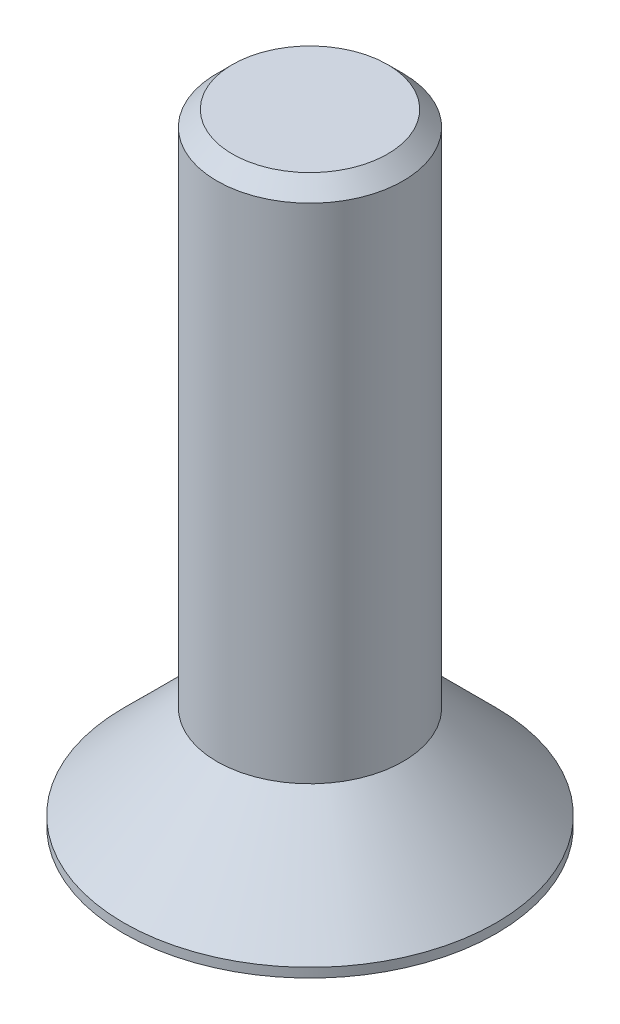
ISO-10303-21;
HEADER;
FILE_DESCRIPTION(('STEP AP214'),'2;1');
FILE_NAME('part.step','',(''),(''),'','','');
FILE_SCHEMA(('AUTOMOTIVE_DESIGN { 1 0 10303 214 1 1 1 1 }'));
ENDSEC;
DATA;
#1=APPLICATION_CONTEXT('core data for automotive mechanical design processes');
#2=APPLICATION_PROTOCOL_DEFINITION('international standard','automotive_design',2000,#1);
#3=PRODUCT_CONTEXT('',#1,'mechanical');
#4=PRODUCT('Part','Part','',(#3));
#5=PRODUCT_RELATED_PRODUCT_CATEGORY('part','',(#4));
#6=PRODUCT_DEFINITION_FORMATION('','',#4);
#7=PRODUCT_DEFINITION_CONTEXT('part definition',#1,'design');
#8=PRODUCT_DEFINITION('design','',#6,#7);
#9=PRODUCT_DEFINITION_SHAPE('','',#8);
#10=(LENGTH_UNIT() NAMED_UNIT(*) SI_UNIT(.MILLI.,.METRE.));
#11=(NAMED_UNIT(*) PLANE_ANGLE_UNIT() SI_UNIT($,.RADIAN.));
#12=(NAMED_UNIT(*) SI_UNIT($,.STERADIAN.) SOLID_ANGLE_UNIT());
#13=UNCERTAINTY_MEASURE_WITH_UNIT(LENGTH_MEASURE(1.E-05),#10,'distance_accuracy_value','');
#14=(GEOMETRIC_REPRESENTATION_CONTEXT(3) GLOBAL_UNCERTAINTY_ASSIGNED_CONTEXT((#13)) GLOBAL_UNIT_ASSIGNED_CONTEXT((#10,
#11,#12)) REPRESENTATION_CONTEXT('',''));
#15=CARTESIAN_POINT('',(0.,0.,0.));
#16=DIRECTION('',(0.,0.,1.));
#17=DIRECTION('',(1.,0.,0.));
#18=AXIS2_PLACEMENT_3D('',#15,#16,#17);
#19=CARTESIAN_POINT('',(-3.,20.,0.));
#20=DIRECTION('',(0.,-1.,0.));
#21=DIRECTION('',(0.,0.,-1.));
#22=AXIS2_PLACEMENT_3D('',#19,#20,#21);
#23=PLANE('',#22);
#24=CARTESIAN_POINT('',(0.,20.,0.));
#25=DIRECTION('',(0.,-1.,0.));
#26=DIRECTION('',(0.,0.,-1.));
#27=AXIS2_PLACEMENT_3D('',#24,#25,#26);
#28=CIRCLE('',#27,2.49999999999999);
#29=CARTESIAN_POINT('',(0.,20.,-2.49999999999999));
#30=VERTEX_POINT('',#29);
#31=EDGE_CURVE('E11',#30,#30,#28,.F.);
#32=ORIENTED_EDGE('',*,*,#31,.T.);
#33=EDGE_LOOP('',(#32));
#34=FACE_BOUND('',#33,.T.);
#35=ADVANCED_FACE('F35',(#34),#23,.F.);
#36=CARTESIAN_POINT('',(0.,0.,0.));
#37=DIRECTION('',(0.,-1.,0.));
#38=DIRECTION('',(0.,0.,-1.));
#39=AXIS2_PLACEMENT_3D('',#36,#37,#38);
#40=CYLINDRICAL_SURFACE('',#39,3.);
#41=CARTESIAN_POINT('',(0.,19.5,0.));
#42=DIRECTION('',(0.,-1.,0.));
#43=DIRECTION('',(0.,0.,-1.));
#44=AXIS2_PLACEMENT_3D('',#41,#42,#43);
#45=CIRCLE('',#44,3.);
#46=CARTESIAN_POINT('',(0.,19.5,-3.));
#47=VERTEX_POINT('',#46);
#48=EDGE_CURVE('E42',#47,#47,#45,.T.);
#49=ORIENTED_EDGE('',*,*,#48,.T.);
#50=EDGE_LOOP('',(#49));
#51=FACE_BOUND('',#50,.T.);
#52=CARTESIAN_POINT('',(0.,3.3,0.));
#53=DIRECTION('',(0.,-1.,0.));
#54=DIRECTION('',(0.,0.,-1.));
#55=AXIS2_PLACEMENT_3D('',#52,#53,#54);
#56=CIRCLE('',#55,3.);
#57=CARTESIAN_POINT('',(0.,3.3,-3.));
#58=VERTEX_POINT('',#57);
#59=EDGE_CURVE('E149',#58,#58,#56,.T.);
#60=ORIENTED_EDGE('',*,*,#59,.F.);
#61=EDGE_LOOP('',(#60));
#62=FACE_BOUND('',#61,.T.);
#63=ADVANCED_FACE('F154',(#51,#62),#40,.T.);
#64=CARTESIAN_POINT('',(0.,3.3,0.));
#65=DIRECTION('',(0.,-1.,0.));
#66=DIRECTION('',(0.,0.,-1.));
#67=AXIS2_PLACEMENT_3D('',#64,#65,#66);
#68=CONICAL_SURFACE('',#67,3.,0.785398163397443);
#69=CARTESIAN_POINT('',(0.,0.299999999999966,0.));
#70=DIRECTION('',(0.,-1.,0.));
#71=DIRECTION('',(0.,0.,-1.));
#72=AXIS2_PLACEMENT_3D('',#69,#70,#71);
#73=CIRCLE('',#72,6.);
#74=CARTESIAN_POINT('',(0.,0.299999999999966,-6.));
#75=VERTEX_POINT('',#74);
#76=EDGE_CURVE('E146',#75,#75,#73,.T.);
#77=ORIENTED_EDGE('',*,*,#76,.F.);
#78=EDGE_LOOP('',(#77));
#79=FACE_BOUND('',#78,.T.);
#80=ORIENTED_EDGE('',*,*,#59,.T.);
#81=EDGE_LOOP('',(#80));
#82=FACE_BOUND('',#81,.T.);
#83=ADVANCED_FACE('F176',(#79,#82),#68,.T.);
#84=CARTESIAN_POINT('',(0.,0.,0.));
#85=DIRECTION('',(0.,-1.,0.));
#86=DIRECTION('',(0.,0.,-1.));
#87=AXIS2_PLACEMENT_3D('',#84,#85,#86);
#88=CYLINDRICAL_SURFACE('',#87,6.);
#89=CARTESIAN_POINT('',(0.,0.,0.));
#90=DIRECTION('',(0.,-1.,0.));
#91=DIRECTION('',(0.,0.,-1.));
#92=AXIS2_PLACEMENT_3D('',#89,#90,#91);
#93=CIRCLE('',#92,6.);
#94=CARTESIAN_POINT('',(0.,0.,-6.));
#95=VERTEX_POINT('',#94);
#96=EDGE_CURVE('E137',#95,#95,#93,.T.);
#97=ORIENTED_EDGE('',*,*,#96,.F.);
#98=EDGE_LOOP('',(#97));
#99=FACE_BOUND('',#98,.T.);
#100=ORIENTED_EDGE('',*,*,#76,.T.);
#101=EDGE_LOOP('',(#100));
#102=FACE_BOUND('',#101,.T.);
#103=ADVANCED_FACE('F168',(#99,#102),#88,.T.);
#104=CARTESIAN_POINT('',(0.,0.,0.));
#105=DIRECTION('',(0.,1.,0.));
#106=DIRECTION('',(0.,0.,1.));
#107=AXIS2_PLACEMENT_3D('',#104,#105,#106);
#108=PLANE('',#107);
#109=DIRECTION('',(-0.866025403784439,0.,0.5));
#110=VECTOR('',#109,1.);
#111=CARTESIAN_POINT('',(2.,0.,1.15470053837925));
#112=LINE('',#111,#110);
#113=CARTESIAN_POINT('',(2.,0.,1.15470053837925));
#114=VERTEX_POINT('',#113);
#115=CARTESIAN_POINT('',(0.,0.,2.3094010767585));
#116=VERTEX_POINT('',#115);
#117=EDGE_CURVE('E103',#114,#116,#112,.T.);
#118=ORIENTED_EDGE('',*,*,#117,.F.);
#119=DIRECTION('',(0.,0.,1.));
#120=VECTOR('',#119,1.);
#121=CARTESIAN_POINT('',(2.,0.,-1.15470053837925));
#122=LINE('',#121,#120);
#123=CARTESIAN_POINT('',(2.,0.,-1.15470053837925));
#124=VERTEX_POINT('',#123);
#125=EDGE_CURVE('E49',#124,#114,#122,.T.);
#126=ORIENTED_EDGE('',*,*,#125,.F.);
#127=DIRECTION('',(0.866025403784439,0.,0.5));
#128=VECTOR('',#127,1.);
#129=CARTESIAN_POINT('',(0.,0.,-2.3094010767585));
#130=LINE('',#129,#128);
#131=CARTESIAN_POINT('',(0.,0.,-2.3094010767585));
#132=VERTEX_POINT('',#131);
#133=EDGE_CURVE('E119',#132,#124,#130,.T.);
#134=ORIENTED_EDGE('',*,*,#133,.F.);
#135=DIRECTION('',(0.866025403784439,0.,-0.5));
#136=VECTOR('',#135,1.);
#137=CARTESIAN_POINT('',(-2.,0.,-1.15470053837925));
#138=LINE('',#137,#136);
#139=CARTESIAN_POINT('',(-2.,0.,-1.15470053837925));
#140=VERTEX_POINT('',#139);
#141=EDGE_CURVE('E113',#140,#132,#138,.T.);
#142=ORIENTED_EDGE('',*,*,#141,.F.);
#143=DIRECTION('',(0.,0.,-1.));
#144=VECTOR('',#143,1.);
#145=CARTESIAN_POINT('',(-2.,0.,1.15470053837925));
#146=LINE('',#145,#144);
#147=CARTESIAN_POINT('',(-2.,0.,1.15470053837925));
#148=VERTEX_POINT('',#147);
#149=EDGE_CURVE('E111',#148,#140,#146,.T.);
#150=ORIENTED_EDGE('',*,*,#149,.F.);
#151=DIRECTION('',(-0.866025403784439,0.,-0.5));
#152=VECTOR('',#151,1.);
#153=CARTESIAN_POINT('',(0.,0.,2.3094010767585));
#154=LINE('',#153,#152);
#155=EDGE_CURVE('E92',#116,#148,#154,.T.);
#156=ORIENTED_EDGE('',*,*,#155,.F.);
#157=EDGE_LOOP('',(#118,#126,#134,#142,#150,#156));
#158=FACE_BOUND('',#157,.T.);
#159=ORIENTED_EDGE('',*,*,#96,.T.);
#160=EDGE_LOOP('',(#159));
#161=FACE_BOUND('',#160,.T.);
#162=ADVANCED_FACE('F107',(#158,#161),#108,.F.);
#163=CARTESIAN_POINT('',(0.,19.5,0.));
#164=DIRECTION('',(0.,-1.,0.));
#165=DIRECTION('',(0.,0.,-1.));
#166=AXIS2_PLACEMENT_3D('',#163,#164,#165);
#167=CONICAL_SURFACE('',#166,3.,0.78539816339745);
#168=ORIENTED_EDGE('',*,*,#31,.F.);
#169=EDGE_LOOP('',(#168));
#170=FACE_BOUND('',#169,.T.);
#171=ORIENTED_EDGE('',*,*,#48,.F.);
#172=EDGE_LOOP('',(#171));
#173=FACE_BOUND('',#172,.T.);
#174=ADVANCED_FACE('F157',(#170,#173),#167,.T.);
#175=CARTESIAN_POINT('',(2.,2.,-1.15470053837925));
#176=DIRECTION('',(1.,0.,0.));
#177=DIRECTION('',(0.,0.,-1.));
#178=AXIS2_PLACEMENT_3D('',#175,#176,#177);
#179=PLANE('',#178);
#180=ORIENTED_EDGE('',*,*,#125,.T.);
#181=DIRECTION('',(0.,-1.,0.));
#182=VECTOR('',#181,1.);
#183=CARTESIAN_POINT('',(2.,2.,1.15470053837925));
#184=LINE('',#183,#182);
#185=CARTESIAN_POINT('',(2.,2.,1.15470053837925));
#186=VERTEX_POINT('',#185);
#187=EDGE_CURVE('E100',#186,#114,#184,.T.);
#188=ORIENTED_EDGE('',*,*,#187,.F.);
#189=DIRECTION('',(0.,0.,1.));
#190=VECTOR('',#189,1.);
#191=CARTESIAN_POINT('',(2.,2.,-1.15470053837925));
#192=LINE('',#191,#190);
#193=CARTESIAN_POINT('',(2.,2.,-1.15470053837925));
#194=VERTEX_POINT('',#193);
#195=EDGE_CURVE('E121',#194,#186,#192,.T.);
#196=ORIENTED_EDGE('',*,*,#195,.F.);
#197=DIRECTION('',(0.,-1.,0.));
#198=VECTOR('',#197,1.);
#199=CARTESIAN_POINT('',(2.,2.,-1.15470053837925));
#200=LINE('',#199,#198);
#201=EDGE_CURVE('E56',#194,#124,#200,.T.);
#202=ORIENTED_EDGE('',*,*,#201,.T.);
#203=EDGE_LOOP('',(#180,#188,#196,#202));
#204=FACE_BOUND('',#203,.T.);
#205=ADVANCED_FACE('F159',(#204),#179,.F.);
#206=CARTESIAN_POINT('',(0.,2.,-2.3094010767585));
#207=DIRECTION('',(0.5,0.,-0.866025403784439));
#208=DIRECTION('',(-0.866025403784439,0.,-0.5));
#209=AXIS2_PLACEMENT_3D('',#206,#207,#208);
#210=PLANE('',#209);
#211=ORIENTED_EDGE('',*,*,#133,.T.);
#212=ORIENTED_EDGE('',*,*,#201,.F.);
#213=DIRECTION('',(0.866025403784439,0.,0.5));
#214=VECTOR('',#213,1.);
#215=CARTESIAN_POINT('',(0.,2.,-2.3094010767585));
#216=LINE('',#215,#214);
#217=CARTESIAN_POINT('',(0.,2.,-2.3094010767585));
#218=VERTEX_POINT('',#217);
#219=EDGE_CURVE('E133',#218,#194,#216,.T.);
#220=ORIENTED_EDGE('',*,*,#219,.F.);
#221=DIRECTION('',(0.,-1.,0.));
#222=VECTOR('',#221,1.);
#223=CARTESIAN_POINT('',(0.,2.,-2.3094010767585));
#224=LINE('',#223,#222);
#225=EDGE_CURVE('E138',#218,#132,#224,.T.);
#226=ORIENTED_EDGE('',*,*,#225,.T.);
#227=EDGE_LOOP('',(#211,#212,#220,#226));
#228=FACE_BOUND('',#227,.T.);
#229=ADVANCED_FACE('F166',(#228),#210,.F.);
#230=CARTESIAN_POINT('',(-2.,2.,-1.15470053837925));
#231=DIRECTION('',(-0.5,0.,-0.866025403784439));
#232=DIRECTION('',(-0.866025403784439,0.,0.5));
#233=AXIS2_PLACEMENT_3D('',#230,#231,#232);
#234=PLANE('',#233);
#235=ORIENTED_EDGE('',*,*,#141,.T.);
#236=ORIENTED_EDGE('',*,*,#225,.F.);
#237=DIRECTION('',(0.866025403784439,0.,-0.5));
#238=VECTOR('',#237,1.);
#239=CARTESIAN_POINT('',(-2.,2.,-1.15470053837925));
#240=LINE('',#239,#238);
#241=CARTESIAN_POINT('',(-2.,2.,-1.15470053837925));
#242=VERTEX_POINT('',#241);
#243=EDGE_CURVE('E130',#242,#218,#240,.T.);
#244=ORIENTED_EDGE('',*,*,#243,.F.);
#245=DIRECTION('',(0.,-1.,0.));
#246=VECTOR('',#245,1.);
#247=CARTESIAN_POINT('',(-2.,2.,-1.15470053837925));
#248=LINE('',#247,#246);
#249=EDGE_CURVE('E140',#242,#140,#248,.T.);
#250=ORIENTED_EDGE('',*,*,#249,.T.);
#251=EDGE_LOOP('',(#235,#236,#244,#250));
#252=FACE_BOUND('',#251,.T.);
#253=ADVANCED_FACE('F215',(#252),#234,.F.);
#254=CARTESIAN_POINT('',(-2.,2.,1.15470053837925));
#255=DIRECTION('',(-1.,0.,0.));
#256=DIRECTION('',(0.,0.,1.));
#257=AXIS2_PLACEMENT_3D('',#254,#255,#256);
#258=PLANE('',#257);
#259=ORIENTED_EDGE('',*,*,#149,.T.);
#260=ORIENTED_EDGE('',*,*,#249,.F.);
#261=DIRECTION('',(0.,0.,-1.));
#262=VECTOR('',#261,1.);
#263=CARTESIAN_POINT('',(-2.,2.,1.15470053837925));
#264=LINE('',#263,#262);
#265=CARTESIAN_POINT('',(-2.,2.,1.15470053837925));
#266=VERTEX_POINT('',#265);
#267=EDGE_CURVE('E127',#266,#242,#264,.T.);
#268=ORIENTED_EDGE('',*,*,#267,.F.);
#269=DIRECTION('',(0.,-1.,0.));
#270=VECTOR('',#269,1.);
#271=CARTESIAN_POINT('',(-2.,2.,1.15470053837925));
#272=LINE('',#271,#270);
#273=EDGE_CURVE('E99',#266,#148,#272,.T.);
#274=ORIENTED_EDGE('',*,*,#273,.T.);
#275=EDGE_LOOP('',(#259,#260,#268,#274));
#276=FACE_BOUND('',#275,.T.);
#277=ADVANCED_FACE('F224',(#276),#258,.F.);
#278=CARTESIAN_POINT('',(0.,2.,2.3094010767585));
#279=DIRECTION('',(-0.5,0.,0.866025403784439));
#280=DIRECTION('',(0.866025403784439,0.,0.5));
#281=AXIS2_PLACEMENT_3D('',#278,#279,#280);
#282=PLANE('',#281);
#283=ORIENTED_EDGE('',*,*,#155,.T.);
#284=ORIENTED_EDGE('',*,*,#273,.F.);
#285=DIRECTION('',(-0.866025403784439,0.,-0.5));
#286=VECTOR('',#285,1.);
#287=CARTESIAN_POINT('',(0.,2.,2.3094010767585));
#288=LINE('',#287,#286);
#289=CARTESIAN_POINT('',(0.,2.,2.3094010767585));
#290=VERTEX_POINT('',#289);
#291=EDGE_CURVE('E95',#290,#266,#288,.T.);
#292=ORIENTED_EDGE('',*,*,#291,.F.);
#293=DIRECTION('',(0.,-1.,0.));
#294=VECTOR('',#293,1.);
#295=CARTESIAN_POINT('',(0.,2.,2.3094010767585));
#296=LINE('',#295,#294);
#297=EDGE_CURVE('E88',#290,#116,#296,.T.);
#298=ORIENTED_EDGE('',*,*,#297,.T.);
#299=EDGE_LOOP('',(#283,#284,#292,#298));
#300=FACE_BOUND('',#299,.T.);
#301=ADVANCED_FACE('F90',(#300),#282,.F.);
#302=CARTESIAN_POINT('',(2.,2.,1.15470053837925));
#303=DIRECTION('',(0.5,0.,0.866025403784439));
#304=DIRECTION('',(0.866025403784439,0.,-0.5));
#305=AXIS2_PLACEMENT_3D('',#302,#303,#304);
#306=PLANE('',#305);
#307=ORIENTED_EDGE('',*,*,#117,.T.);
#308=ORIENTED_EDGE('',*,*,#297,.F.);
#309=DIRECTION('',(-0.866025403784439,0.,0.5));
#310=VECTOR('',#309,1.);
#311=CARTESIAN_POINT('',(2.,2.,1.15470053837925));
#312=LINE('',#311,#310);
#313=EDGE_CURVE('E124',#186,#290,#312,.T.);
#314=ORIENTED_EDGE('',*,*,#313,.F.);
#315=ORIENTED_EDGE('',*,*,#187,.T.);
#316=EDGE_LOOP('',(#307,#308,#314,#315));
#317=FACE_BOUND('',#316,.T.);
#318=ADVANCED_FACE('F104',(#317),#306,.F.);
#319=CARTESIAN_POINT('',(2.,2.,-1.15470053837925));
#320=DIRECTION('',(0.,1.,0.));
#321=DIRECTION('',(0.,0.,1.));
#322=AXIS2_PLACEMENT_3D('',#319,#320,#321);
#323=PLANE('',#322);
#324=ORIENTED_EDGE('',*,*,#195,.T.);
#325=ORIENTED_EDGE('',*,*,#313,.T.);
#326=ORIENTED_EDGE('',*,*,#291,.T.);
#327=ORIENTED_EDGE('',*,*,#267,.T.);
#328=ORIENTED_EDGE('',*,*,#243,.T.);
#329=ORIENTED_EDGE('',*,*,#219,.T.);
#330=EDGE_LOOP('',(#324,#325,#326,#327,#328,#329));
#331=FACE_BOUND('',#330,.T.);
#332=ADVANCED_FACE('F251',(#331),#323,.F.);
#333=CLOSED_SHELL('',(#35,#63,#83,#103,#162,#174,#205,#229,#253,#277,#301,#318,#332));
#334=MANIFOLD_SOLID_BREP('B2',#333);
#335=ADVANCED_BREP_SHAPE_REPRESENTATION('',(#18,#334),#14);
#336=SHAPE_DEFINITION_REPRESENTATION(#9,#335);
ENDSEC;
END-ISO-10303-21;
